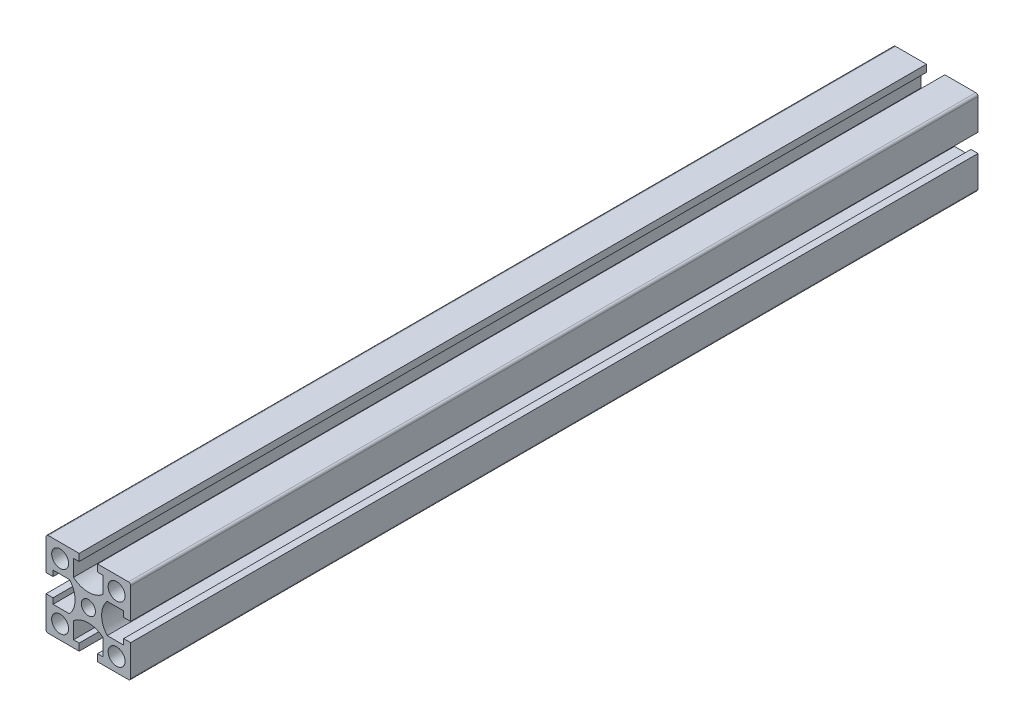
from build123d import *

# Parameters (mm, degrees)
EXTRUDE_1_DEPTH = 150


with BuildPart() as part:
    # Sketch 1 → Extrude 1 (new, symmetric)
    with BuildSketch(Plane.XY):
        with BuildLine():
            Line((-15, 14.2), (-15, 3.25))
            Line((-15, 3.25), (-12.5, 3.25))
            Line((-12.5, 3.25), (-12.5, 5.25))
            Line((-12.5, 5.25), (-6.663651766, 5.25))
            ThreePointArc((-6.663651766, 5.25), (-4.7, 0), (-6.663651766, -5.25))
            Line((-6.663651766, -5.25), (-12.5, -5.25))
            Line((-12.5, -5.25), (-12.5, -3.25))
            Line((-12.5, -3.25), (-15, -3.25))
            Line((-15, -3.25), (-15, -14.2))
            ThreePointArc((-15, -14.2), (-14.765685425, -14.765685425), (-14.2, -15))
            Line((-14.2, -15), (-3.25, -15))
            Line((-3.25, -15), (-3.25, -12.5))
            Line((-3.25, -12.5), (-5.25, -12.5))
            Line((-5.25, -12.5), (-5.25, -6.663651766))
            ThreePointArc((-5.25, -6.663651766), (0, -4.7), (5.25, -6.663651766))
            Line((5.25, -6.663651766), (5.25, -12.5))
            Line((5.25, -12.5), (3.25, -12.5))
            Line((3.25, -12.5), (3.25, -15))
            Line((3.25, -15), (14.2, -15))
            ThreePointArc((14.2, -15), (14.765685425, -14.765685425), (15, -14.2))
            Line((15, -14.2), (15, -3.25))
            Line((15, -3.25), (12.5, -3.25))
            Line((12.5, -3.25), (12.5, -5.25))
            Line((12.5, -5.25), (6.663651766, -5.25))
            ThreePointArc((6.663651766, -5.25), (4.7, 0), (6.663651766, 5.25))
            Line((6.663651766, 5.25), (12.5, 5.25))
            Line((12.5, 5.25), (12.5, 3.25))
            Line((12.5, 3.25), (15, 3.25))
            Line((15, 3.25), (15, 14.2))
            ThreePointArc((15, 14.2), (14.765685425, 14.765685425), (14.2, 15))
            Line((14.2, 15), (3.25, 15))
            Line((3.25, 15), (3.25, 12.5))
            Line((3.25, 12.5), (5.25, 12.5))
            Line((5.25, 12.5), (5.25, 6.663651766))
            ThreePointArc((5.25, 6.663651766), (0, 4.7), (-5.25, 6.663651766))
            Line((-5.25, 6.663651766), (-5.25, 12.5))
            Line((-5.25, 12.5), (-3.25, 12.5))
            Line((-3.25, 12.5), (-3.25, 15))
            Line((-3.25, 15), (-14.2, 15))
            ThreePointArc((-14.2, 15), (-14.765685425, 14.765685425), (-15, 14.2))
        make_face()
        with BuildLine():
            ThreePointArc((13, -10), (10, -7), (7, -10))
            ThreePointArc((7, -10), (10, -13), (13, -10))
        make_face(mode=Mode.SUBTRACT)
        with BuildLine():
            ThreePointArc((7, 10), (10, 7), (13, 10))
            ThreePointArc((13, 10), (10, 13), (7, 10))
        make_face(mode=Mode.SUBTRACT)
        with BuildLine():
            ThreePointArc((-7, -10), (-10, -7), (-13, -10))
            ThreePointArc((-13, -10), (-10, -13), (-7, -10))
        make_face(mode=Mode.SUBTRACT)
        with BuildLine():
            ThreePointArc((-13, 10), (-10, 7), (-7, 10))
            ThreePointArc((-7, 10), (-10, 13), (-13, 10))
        make_face(mode=Mode.SUBTRACT)
        with BuildLine():
            ThreePointArc((2.5, 0), (0, 2.5), (-2.5, 0))
            ThreePointArc((-2.5, 0), (0, -2.5), (2.5, 0))
        make_face(mode=Mode.SUBTRACT)
    extrude(amount=EXTRUDE_1_DEPTH, both=True)


solid = part.part
